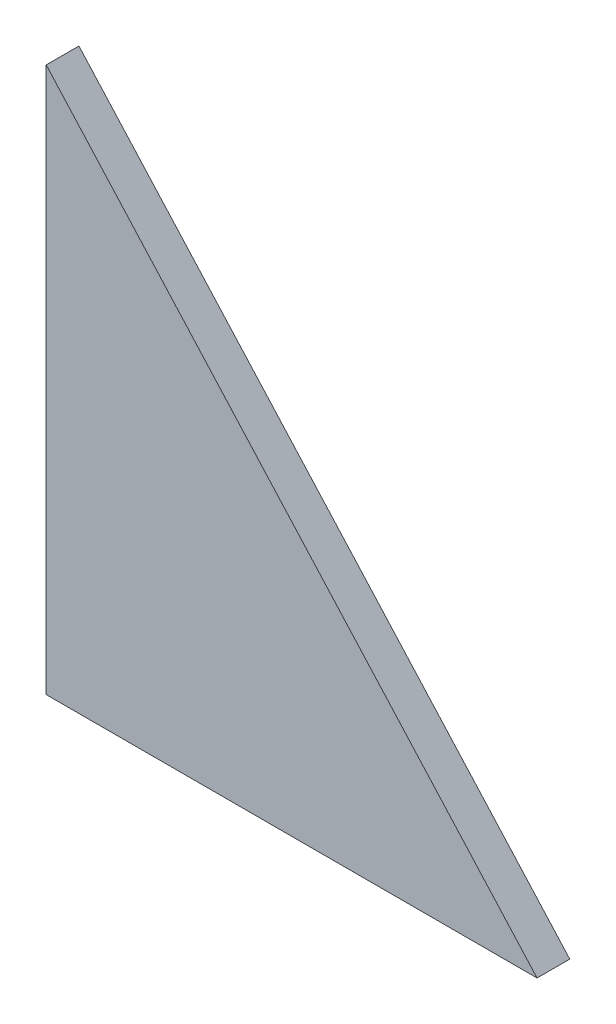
from build123d import *

# Parameters (mm, degrees)
EXTRUDE_1_DEPTH = 6


with BuildPart() as part:
    # Sketch 1 → Extrude 1 (new body)
    with BuildSketch(Plane.XY):
        Polygon((0, 100), (0, 0), (90, 0), align=None)
    extrude(amount=EXTRUDE_1_DEPTH)


solid = part.part
